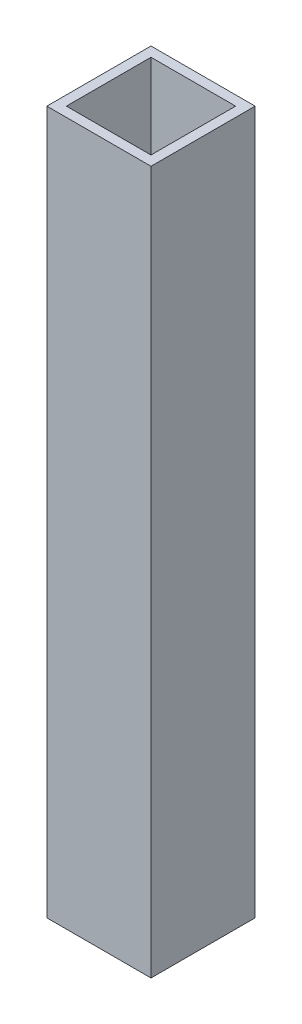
ISO-10303-21;
HEADER;
FILE_DESCRIPTION(('STEP AP214'),'2;1');
FILE_NAME('part.step','',(''),(''),'','','');
FILE_SCHEMA(('AUTOMOTIVE_DESIGN { 1 0 10303 214 1 1 1 1 }'));
ENDSEC;
DATA;
#1=APPLICATION_CONTEXT('core data for automotive mechanical design processes');
#2=APPLICATION_PROTOCOL_DEFINITION('international standard','automotive_design',2000,#1);
#3=PRODUCT_CONTEXT('',#1,'mechanical');
#4=PRODUCT('Part','Part','',(#3));
#5=PRODUCT_RELATED_PRODUCT_CATEGORY('part','',(#4));
#6=PRODUCT_DEFINITION_FORMATION('','',#4);
#7=PRODUCT_DEFINITION_CONTEXT('part definition',#1,'design');
#8=PRODUCT_DEFINITION('design','',#6,#7);
#9=PRODUCT_DEFINITION_SHAPE('','',#8);
#10=(LENGTH_UNIT() NAMED_UNIT(*) SI_UNIT(.MILLI.,.METRE.));
#11=(NAMED_UNIT(*) PLANE_ANGLE_UNIT() SI_UNIT($,.RADIAN.));
#12=(NAMED_UNIT(*) SI_UNIT($,.STERADIAN.) SOLID_ANGLE_UNIT());
#13=UNCERTAINTY_MEASURE_WITH_UNIT(LENGTH_MEASURE(1.E-05),#10,'distance_accuracy_value','');
#14=(GEOMETRIC_REPRESENTATION_CONTEXT(3) GLOBAL_UNCERTAINTY_ASSIGNED_CONTEXT((#13)) GLOBAL_UNIT_ASSIGNED_CONTEXT((#10,
#11,#12)) REPRESENTATION_CONTEXT('',''));
#15=CARTESIAN_POINT('',(0.,0.,0.));
#16=DIRECTION('',(0.,0.,1.));
#17=DIRECTION('',(1.,0.,0.));
#18=AXIS2_PLACEMENT_3D('',#15,#16,#17);
#19=CARTESIAN_POINT('',(25.4,-171.45,50.8));
#20=DIRECTION('',(1.,0.,0.));
#21=DIRECTION('',(0.,0.,-1.));
#22=AXIS2_PLACEMENT_3D('',#19,#20,#21);
#23=PLANE('',#22);
#24=DIRECTION('',(0.,0.,-1.));
#25=VECTOR('',#24,1.);
#26=CARTESIAN_POINT('',(25.4,171.45,50.8));
#27=LINE('',#26,#25);
#28=CARTESIAN_POINT('',(25.4,171.45,50.8));
#29=VERTEX_POINT('',#28);
#30=CARTESIAN_POINT('',(25.4,171.45,0.));
#31=VERTEX_POINT('',#30);
#32=EDGE_CURVE('E129',#29,#31,#27,.T.);
#33=ORIENTED_EDGE('',*,*,#32,.F.);
#34=DIRECTION('',(0.,1.,0.));
#35=VECTOR('',#34,1.);
#36=CARTESIAN_POINT('',(25.4,-171.45,50.8));
#37=LINE('',#36,#35);
#38=CARTESIAN_POINT('',(25.4,-171.45,50.8));
#39=VERTEX_POINT('',#38);
#40=EDGE_CURVE('E11',#39,#29,#37,.T.);
#41=ORIENTED_EDGE('',*,*,#40,.F.);
#42=DIRECTION('',(0.,0.,-1.));
#43=VECTOR('',#42,1.);
#44=CARTESIAN_POINT('',(25.4,-171.45,50.8));
#45=LINE('',#44,#43);
#46=CARTESIAN_POINT('',(25.4,-171.45,0.));
#47=VERTEX_POINT('',#46);
#48=EDGE_CURVE('E133',#39,#47,#45,.T.);
#49=ORIENTED_EDGE('',*,*,#48,.T.);
#50=DIRECTION('',(0.,1.,0.));
#51=VECTOR('',#50,1.);
#52=CARTESIAN_POINT('',(25.4,-171.45,0.));
#53=LINE('',#52,#51);
#54=EDGE_CURVE('E34',#47,#31,#53,.T.);
#55=ORIENTED_EDGE('',*,*,#54,.T.);
#56=EDGE_LOOP('',(#33,#41,#49,#55));
#57=FACE_BOUND('',#56,.T.);
#58=ADVANCED_FACE('F31',(#57),#23,.T.);
#59=CARTESIAN_POINT('',(-25.4,-171.45,50.8));
#60=DIRECTION('',(0.,0.,1.));
#61=DIRECTION('',(1.,0.,0.));
#62=AXIS2_PLACEMENT_3D('',#59,#60,#61);
#63=PLANE('',#62);
#64=DIRECTION('',(1.,0.,0.));
#65=VECTOR('',#64,1.);
#66=CARTESIAN_POINT('',(-25.4,171.45,50.8));
#67=LINE('',#66,#65);
#68=CARTESIAN_POINT('',(-25.4,171.45,50.8));
#69=VERTEX_POINT('',#68);
#70=EDGE_CURVE('E137',#69,#29,#67,.T.);
#71=ORIENTED_EDGE('',*,*,#70,.F.);
#72=DIRECTION('',(0.,1.,0.));
#73=VECTOR('',#72,1.);
#74=CARTESIAN_POINT('',(-25.4,-171.45,50.8));
#75=LINE('',#74,#73);
#76=CARTESIAN_POINT('',(-25.4,-171.45,50.8));
#77=VERTEX_POINT('',#76);
#78=EDGE_CURVE('E39',#77,#69,#75,.T.);
#79=ORIENTED_EDGE('',*,*,#78,.F.);
#80=DIRECTION('',(1.,0.,0.));
#81=VECTOR('',#80,1.);
#82=CARTESIAN_POINT('',(-25.4,-171.45,50.8));
#83=LINE('',#82,#81);
#84=EDGE_CURVE('E143',#77,#39,#83,.T.);
#85=ORIENTED_EDGE('',*,*,#84,.T.);
#86=ORIENTED_EDGE('',*,*,#40,.T.);
#87=EDGE_LOOP('',(#71,#79,#85,#86));
#88=FACE_BOUND('',#87,.T.);
#89=ADVANCED_FACE('F169',(#88),#63,.T.);
#90=CARTESIAN_POINT('',(-25.4,-171.45,0.));
#91=DIRECTION('',(-1.,0.,0.));
#92=DIRECTION('',(0.,0.,1.));
#93=AXIS2_PLACEMENT_3D('',#90,#91,#92);
#94=PLANE('',#93);
#95=DIRECTION('',(0.,0.,1.));
#96=VECTOR('',#95,1.);
#97=CARTESIAN_POINT('',(-25.4,171.45,0.));
#98=LINE('',#97,#96);
#99=CARTESIAN_POINT('',(-25.4,171.45,0.));
#100=VERTEX_POINT('',#99);
#101=EDGE_CURVE('E151',#100,#69,#98,.T.);
#102=ORIENTED_EDGE('',*,*,#101,.F.);
#103=DIRECTION('',(0.,1.,0.));
#104=VECTOR('',#103,1.);
#105=CARTESIAN_POINT('',(-25.4,-171.45,0.));
#106=LINE('',#105,#104);
#107=CARTESIAN_POINT('',(-25.4,-171.45,0.));
#108=VERTEX_POINT('',#107);
#109=EDGE_CURVE('E156',#108,#100,#106,.T.);
#110=ORIENTED_EDGE('',*,*,#109,.F.);
#111=DIRECTION('',(0.,0.,1.));
#112=VECTOR('',#111,1.);
#113=CARTESIAN_POINT('',(-25.4,-171.45,0.));
#114=LINE('',#113,#112);
#115=EDGE_CURVE('E140',#108,#77,#114,.T.);
#116=ORIENTED_EDGE('',*,*,#115,.T.);
#117=ORIENTED_EDGE('',*,*,#78,.T.);
#118=EDGE_LOOP('',(#102,#110,#116,#117));
#119=FACE_BOUND('',#118,.T.);
#120=ADVANCED_FACE('F173',(#119),#94,.T.);
#121=CARTESIAN_POINT('',(25.4,-171.45,0.));
#122=DIRECTION('',(0.,0.,-1.));
#123=DIRECTION('',(-1.,0.,0.));
#124=AXIS2_PLACEMENT_3D('',#121,#122,#123);
#125=PLANE('',#124);
#126=DIRECTION('',(-1.,0.,0.));
#127=VECTOR('',#126,1.);
#128=CARTESIAN_POINT('',(25.4,171.45,0.));
#129=LINE('',#128,#127);
#130=EDGE_CURVE('E148',#31,#100,#129,.T.);
#131=ORIENTED_EDGE('',*,*,#130,.F.);
#132=ORIENTED_EDGE('',*,*,#54,.F.);
#133=DIRECTION('',(-1.,0.,0.));
#134=VECTOR('',#133,1.);
#135=CARTESIAN_POINT('',(25.4,-171.45,0.));
#136=LINE('',#135,#134);
#137=EDGE_CURVE('E136',#47,#108,#136,.T.);
#138=ORIENTED_EDGE('',*,*,#137,.T.);
#139=ORIENTED_EDGE('',*,*,#109,.T.);
#140=EDGE_LOOP('',(#131,#132,#138,#139));
#141=FACE_BOUND('',#140,.T.);
#142=ADVANCED_FACE('F164',(#141),#125,.T.);
#143=CARTESIAN_POINT('',(25.4,-171.45,0.));
#144=DIRECTION('',(0.,1.,0.));
#145=DIRECTION('',(0.,0.,1.));
#146=AXIS2_PLACEMENT_3D('',#143,#144,#145);
#147=PLANE('',#146);
#148=DIRECTION('',(0.,0.,-1.));
#149=VECTOR('',#148,1.);
#150=CARTESIAN_POINT('',(20.6375,-171.45,4.7625));
#151=LINE('',#150,#149);
#152=CARTESIAN_POINT('',(20.6375,-171.45,46.0375));
#153=VERTEX_POINT('',#152);
#154=CARTESIAN_POINT('',(20.6375,-171.45,4.7625));
#155=VERTEX_POINT('',#154);
#156=EDGE_CURVE('E104',#153,#155,#151,.T.);
#157=ORIENTED_EDGE('',*,*,#156,.T.);
#158=DIRECTION('',(-1.,0.,0.));
#159=VECTOR('',#158,1.);
#160=CARTESIAN_POINT('',(-20.6375,-171.45,4.7625));
#161=LINE('',#160,#159);
#162=CARTESIAN_POINT('',(-20.6375,-171.45,4.7625));
#163=VERTEX_POINT('',#162);
#164=EDGE_CURVE('E98',#155,#163,#161,.T.);
#165=ORIENTED_EDGE('',*,*,#164,.T.);
#166=DIRECTION('',(0.,0.,1.));
#167=VECTOR('',#166,1.);
#168=CARTESIAN_POINT('',(-20.6375,-171.45,46.0375));
#169=LINE('',#168,#167);
#170=CARTESIAN_POINT('',(-20.6375,-171.45,46.0375));
#171=VERTEX_POINT('',#170);
#172=EDGE_CURVE('E107',#163,#171,#169,.T.);
#173=ORIENTED_EDGE('',*,*,#172,.T.);
#174=DIRECTION('',(1.,0.,0.));
#175=VECTOR('',#174,1.);
#176=CARTESIAN_POINT('',(20.6375,-171.45,46.0375));
#177=LINE('',#176,#175);
#178=EDGE_CURVE('E47',#171,#153,#177,.T.);
#179=ORIENTED_EDGE('',*,*,#178,.T.);
#180=EDGE_LOOP('',(#157,#165,#173,#179));
#181=FACE_BOUND('',#180,.T.);
#182=ORIENTED_EDGE('',*,*,#48,.F.);
#183=ORIENTED_EDGE('',*,*,#84,.F.);
#184=ORIENTED_EDGE('',*,*,#115,.F.);
#185=ORIENTED_EDGE('',*,*,#137,.F.);
#186=EDGE_LOOP('',(#182,#183,#184,#185));
#187=FACE_BOUND('',#186,.T.);
#188=ADVANCED_FACE('F111',(#181,#187),#147,.F.);
#189=CARTESIAN_POINT('',(25.4,171.45,0.));
#190=DIRECTION('',(0.,1.,0.));
#191=DIRECTION('',(0.,0.,1.));
#192=AXIS2_PLACEMENT_3D('',#189,#190,#191);
#193=PLANE('',#192);
#194=DIRECTION('',(-1.,0.,0.));
#195=VECTOR('',#194,1.);
#196=CARTESIAN_POINT('',(-20.6375,171.45,4.7625));
#197=LINE('',#196,#195);
#198=CARTESIAN_POINT('',(20.6375,171.45,4.7625));
#199=VERTEX_POINT('',#198);
#200=CARTESIAN_POINT('',(-20.6375,171.45,4.7625));
#201=VERTEX_POINT('',#200);
#202=EDGE_CURVE('E55',#199,#201,#197,.T.);
#203=ORIENTED_EDGE('',*,*,#202,.F.);
#204=DIRECTION('',(0.,0.,-1.));
#205=VECTOR('',#204,1.);
#206=CARTESIAN_POINT('',(20.6375,171.45,4.7625));
#207=LINE('',#206,#205);
#208=CARTESIAN_POINT('',(20.6375,171.45,46.0375));
#209=VERTEX_POINT('',#208);
#210=EDGE_CURVE('E114',#209,#199,#207,.T.);
#211=ORIENTED_EDGE('',*,*,#210,.F.);
#212=DIRECTION('',(1.,0.,0.));
#213=VECTOR('',#212,1.);
#214=CARTESIAN_POINT('',(20.6375,171.45,46.0375));
#215=LINE('',#214,#213);
#216=CARTESIAN_POINT('',(-20.6375,171.45,46.0375));
#217=VERTEX_POINT('',#216);
#218=EDGE_CURVE('E117',#217,#209,#215,.T.);
#219=ORIENTED_EDGE('',*,*,#218,.F.);
#220=DIRECTION('',(0.,0.,1.));
#221=VECTOR('',#220,1.);
#222=CARTESIAN_POINT('',(-20.6375,171.45,46.0375));
#223=LINE('',#222,#221);
#224=EDGE_CURVE('E123',#201,#217,#223,.T.);
#225=ORIENTED_EDGE('',*,*,#224,.F.);
#226=EDGE_LOOP('',(#203,#211,#219,#225));
#227=FACE_BOUND('',#226,.T.);
#228=ORIENTED_EDGE('',*,*,#32,.T.);
#229=ORIENTED_EDGE('',*,*,#130,.T.);
#230=ORIENTED_EDGE('',*,*,#101,.T.);
#231=ORIENTED_EDGE('',*,*,#70,.T.);
#232=EDGE_LOOP('',(#228,#229,#230,#231));
#233=FACE_BOUND('',#232,.T.);
#234=ADVANCED_FACE('F166',(#227,#233),#193,.T.);
#235=CARTESIAN_POINT('',(-20.6375,-171.45,4.7625));
#236=DIRECTION('',(0.,0.,-1.));
#237=DIRECTION('',(-1.,0.,0.));
#238=AXIS2_PLACEMENT_3D('',#235,#236,#237);
#239=PLANE('',#238);
#240=ORIENTED_EDGE('',*,*,#202,.T.);
#241=DIRECTION('',(0.,1.,0.));
#242=VECTOR('',#241,1.);
#243=CARTESIAN_POINT('',(-20.6375,-171.45,4.7625));
#244=LINE('',#243,#242);
#245=EDGE_CURVE('E94',#163,#201,#244,.T.);
#246=ORIENTED_EDGE('',*,*,#245,.F.);
#247=ORIENTED_EDGE('',*,*,#164,.F.);
#248=DIRECTION('',(0.,1.,0.));
#249=VECTOR('',#248,1.);
#250=CARTESIAN_POINT('',(20.6375,-171.45,4.7625));
#251=LINE('',#250,#249);
#252=EDGE_CURVE('E127',#155,#199,#251,.T.);
#253=ORIENTED_EDGE('',*,*,#252,.T.);
#254=EDGE_LOOP('',(#240,#246,#247,#253));
#255=FACE_BOUND('',#254,.T.);
#256=ADVANCED_FACE('F96',(#255),#239,.F.);
#257=CARTESIAN_POINT('',(20.6375,-171.45,4.7625));
#258=DIRECTION('',(1.,0.,0.));
#259=DIRECTION('',(0.,0.,-1.));
#260=AXIS2_PLACEMENT_3D('',#257,#258,#259);
#261=PLANE('',#260);
#262=ORIENTED_EDGE('',*,*,#210,.T.);
#263=ORIENTED_EDGE('',*,*,#252,.F.);
#264=ORIENTED_EDGE('',*,*,#156,.F.);
#265=DIRECTION('',(0.,1.,0.));
#266=VECTOR('',#265,1.);
#267=CARTESIAN_POINT('',(20.6375,-171.45,46.0375));
#268=LINE('',#267,#266);
#269=EDGE_CURVE('E130',#153,#209,#268,.T.);
#270=ORIENTED_EDGE('',*,*,#269,.T.);
#271=EDGE_LOOP('',(#262,#263,#264,#270));
#272=FACE_BOUND('',#271,.T.);
#273=ADVANCED_FACE('F224',(#272),#261,.F.);
#274=CARTESIAN_POINT('',(20.6375,-171.45,46.0375));
#275=DIRECTION('',(0.,0.,1.));
#276=DIRECTION('',(1.,0.,0.));
#277=AXIS2_PLACEMENT_3D('',#274,#275,#276);
#278=PLANE('',#277);
#279=ORIENTED_EDGE('',*,*,#218,.T.);
#280=ORIENTED_EDGE('',*,*,#269,.F.);
#281=ORIENTED_EDGE('',*,*,#178,.F.);
#282=DIRECTION('',(0.,1.,0.));
#283=VECTOR('',#282,1.);
#284=CARTESIAN_POINT('',(-20.6375,-171.45,46.0375));
#285=LINE('',#284,#283);
#286=EDGE_CURVE('E103',#171,#217,#285,.T.);
#287=ORIENTED_EDGE('',*,*,#286,.T.);
#288=EDGE_LOOP('',(#279,#280,#281,#287));
#289=FACE_BOUND('',#288,.T.);
#290=ADVANCED_FACE('F233',(#289),#278,.F.);
#291=CARTESIAN_POINT('',(-20.6375,-171.45,46.0375));
#292=DIRECTION('',(-1.,0.,0.));
#293=DIRECTION('',(0.,0.,1.));
#294=AXIS2_PLACEMENT_3D('',#291,#292,#293);
#295=PLANE('',#294);
#296=ORIENTED_EDGE('',*,*,#224,.T.);
#297=ORIENTED_EDGE('',*,*,#286,.F.);
#298=ORIENTED_EDGE('',*,*,#172,.F.);
#299=ORIENTED_EDGE('',*,*,#245,.T.);
#300=EDGE_LOOP('',(#296,#297,#298,#299));
#301=FACE_BOUND('',#300,.T.);
#302=ADVANCED_FACE('F108',(#301),#295,.F.);
#303=CLOSED_SHELL('',(#58,#89,#120,#142,#188,#234,#256,#273,#290,#302));
#304=MANIFOLD_SOLID_BREP('B2',#303);
#305=ADVANCED_BREP_SHAPE_REPRESENTATION('',(#18,#304),#14);
#306=SHAPE_DEFINITION_REPRESENTATION(#9,#305);
ENDSEC;
END-ISO-10303-21;
